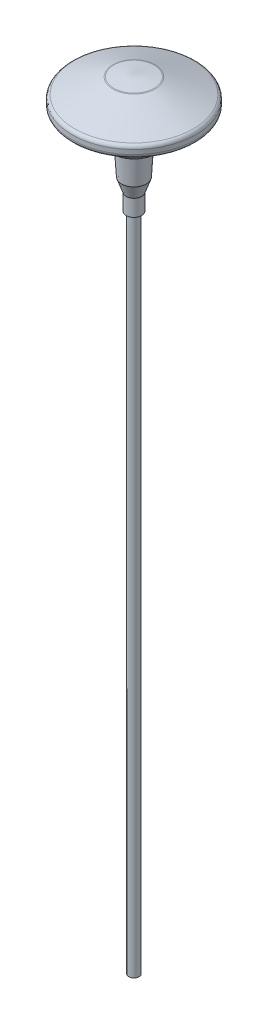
from build123d import *

# Parameters (mm, degrees)
SKETCH2_R = 3.175


with BuildPart() as part:
    # Sketch1 → Base-Revolve (revolve)
    with BuildSketch(Plane(origin=(0, 5.799731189, 0), x_dir=(1, 0, 0), z_dir=(0, 0, 1)), mode=Mode.PRIVATE) as base_revolve_sk:
        with BuildLine():
            Line((0, -79.287481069), (4.7752, -79.287481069))
            Line((4.7752, -79.287481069), (4.7752, -69.127481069))
            Line((4.7752, -69.127481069), (7.62, -61.044731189))
            Line((7.62, -61.044731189), (8.7376, -41.994731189))
            Line((8.7376, -41.994731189), (13.5128, -41.994731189))
            Line((13.5128, -41.994731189), (18.9581316, -30.359622))
            ThreePointArc((18.9581316, -30.359622), (19.623222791, -29.492842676), (20.590895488, -28.985632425))
            Line((20.590895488, -28.985632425), (36.227756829, -24.724882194))
            ThreePointArc((36.227756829, -24.724882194), (37.578378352, -23.816224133), (38.1, -22.274229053))
            Line((38.1, -22.274229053), (38.1, -19.584394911))
            ThreePointArc((38.1, -19.584394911), (37.663290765, -18.160397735), (36.503332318, -17.226064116))
            Line((36.503332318, -17.226064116), (12.974341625, -7.814467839))
            ThreePointArc((12.974341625, -7.814467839), (12.695518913, -7.721262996), (12.407794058, -7.660900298))
            Line((12.407794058, -7.660900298), (0, -5.799731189))
            Line((0, -5.799731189), (0, -79.287481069))
        make_face()
    revolve(base_revolve_sk.sketch.rotate(Axis((0, 23.908070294, 0), (0, -1, 0)), 90), axis=Axis((0, 23.908070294, 0), (0, -1, 0)))

    # Boss-Sweep1: sweep along a path in Sketch3
    with BuildLine(Plane.XY) as boss_sweep1_path:
        Line((0, -73.48774988), (0, -479.88774988))
    # Sketch2 → Boss-Sweep1 (sweep)
    with BuildSketch(Plane.XZ.offset(73.48774988)):
        Circle(SKETCH2_R)
    sweep(path=boss_sweep1_path.line)


solid = part.part
